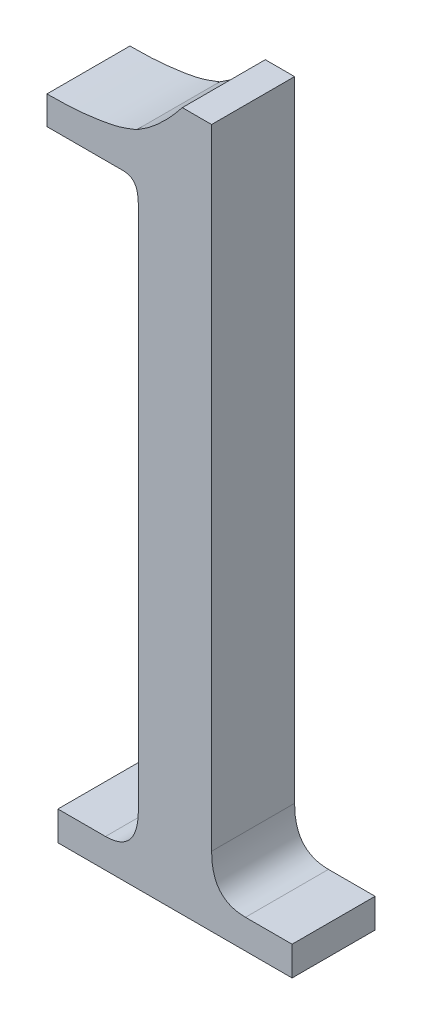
from build123d import *

# Parameters (mm, degrees)
EXTRUDE_1_DEPTH = 3


with BuildPart() as part:
    # Sketch 1 → Extrude 1 (new body)
    with BuildSketch(Plane.XY):
        with BuildLine():
            Line((8.333333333, 23.941798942), (9.391534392, 23.941798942))
            Line((9.391534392, 23.941798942), (9.391534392, 1.19047619))
            add(Edge.make_bspline(
                [(9.391534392, 1.19047619), (9.394510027, 1.075795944), (9.400082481, 0.861034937), (9.460891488, 0.562738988), (9.550216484, 0.304805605), (9.689663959, 0.09557894), (9.867415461, -0.068694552), (10.084001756, -0.181353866), (10.33760314, -0.252311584), (10.519428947, -0.260296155), (10.616304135, -0.264550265)],
                knots=[0, 0, 0, 0, 1.264665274, 2.368331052, 3.349993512, 4.260471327, 5.115861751, 5.995442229, 6.931989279, 8, 8, 8, 8], degree=3))
            Line((10.616304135, -0.264550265), (12.301587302, -0.264550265))
            Line((12.301587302, -0.264550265), (12.301587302, -1.322751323))
            Line((12.301587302, -1.322751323), (3.835978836, -1.322751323))
            Line((3.835978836, -1.322751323), (3.835978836, -0.264550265))
            Line((3.835978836, -0.264550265), (5.555555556, -0.264550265))
            add(Edge.make_bspline(
                [(5.555555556, -0.264550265), (5.649156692, -0.260173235), (5.826121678, -0.251897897), (6.073396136, -0.181357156), (6.285093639, -0.068494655), (6.458264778, 0.095893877), (6.59110676, 0.306367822), (6.683300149, 0.561959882), (6.73549813, 0.861767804), (6.742361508, 1.075944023), (6.746031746, 1.19047619)],
                knots=[0, 0, 0, 0, 1.044559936, 1.974874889, 2.849045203, 3.701403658, 4.612900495, 5.606443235, 6.72002949, 8, 8, 8, 8], degree=3))
            Line((6.746031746, 1.19047619), (6.746031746, 20.105820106))
            add(Edge.make_bspline(
                [(6.746031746, 20.105820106), (6.740635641, 20.222401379), (6.731096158, 20.428499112), (6.641200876, 20.700578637), (6.452302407, 20.876141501), (6.296890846, 20.891545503), (6.216931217, 20.899470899)],
                knots=[0, 0, 0, 0, 1.299999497, 2.298198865, 3.12441914, 4, 4, 4, 4], degree=3))
            Line((6.216931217, 20.899470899), (3.439153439, 20.899470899))
            Line((3.439153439, 20.899470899), (3.439153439, 21.923378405))
            add(Edge.make_bspline(
                [(3.439153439, 21.923378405), (3.771084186, 21.926944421), (4.39739537, 21.933673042), (5.270853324, 22.036637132), (6.03109212, 22.172154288), (6.475159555, 22.343255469), (6.682343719, 22.42308446)],
                knots=[0, 0, 0, 0, 1.20525377, 2.274160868, 3.194792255, 4, 4, 4, 4], degree=3))
            add(Edge.make_bspline(
                [(6.682343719, 22.42308446), (6.821903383, 22.509582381), (7.113448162, 22.690279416), (7.522950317, 23.042881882), (7.941731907, 23.456778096), (8.199243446, 23.775720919), (8.333333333, 23.941798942)],
                knots=[0, 0, 0, 0, 0.872028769, 1.821697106, 2.865726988, 4, 4, 4, 4], degree=3))
        make_face()
    extrude(amount=EXTRUDE_1_DEPTH)


solid = part.part
